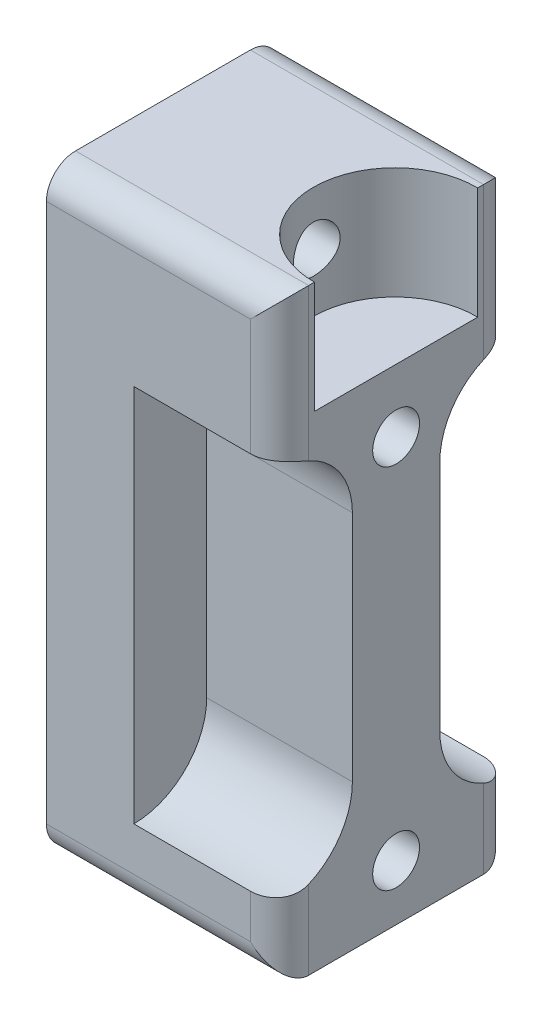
ISO-10303-21;
HEADER;
FILE_DESCRIPTION(('STEP AP214'),'2;1');
FILE_NAME('part.step','',(''),(''),'','','');
FILE_SCHEMA(('AUTOMOTIVE_DESIGN { 1 0 10303 214 1 1 1 1 }'));
ENDSEC;
DATA;
#1=APPLICATION_CONTEXT('core data for automotive mechanical design processes');
#2=APPLICATION_PROTOCOL_DEFINITION('international standard','automotive_design',2000,#1);
#3=PRODUCT_CONTEXT('',#1,'mechanical');
#4=PRODUCT('Part','Part','',(#3));
#5=PRODUCT_RELATED_PRODUCT_CATEGORY('part','',(#4));
#6=PRODUCT_DEFINITION_FORMATION('','',#4);
#7=PRODUCT_DEFINITION_CONTEXT('part definition',#1,'design');
#8=PRODUCT_DEFINITION('design','',#6,#7);
#9=PRODUCT_DEFINITION_SHAPE('','',#8);
#10=(LENGTH_UNIT() NAMED_UNIT(*) SI_UNIT(.MILLI.,.METRE.));
#11=(NAMED_UNIT(*) PLANE_ANGLE_UNIT() SI_UNIT($,.RADIAN.));
#12=(NAMED_UNIT(*) SI_UNIT($,.STERADIAN.) SOLID_ANGLE_UNIT());
#13=UNCERTAINTY_MEASURE_WITH_UNIT(LENGTH_MEASURE(1.E-05),#10,'distance_accuracy_value','');
#14=(GEOMETRIC_REPRESENTATION_CONTEXT(3) GLOBAL_UNCERTAINTY_ASSIGNED_CONTEXT((#13)) GLOBAL_UNIT_ASSIGNED_CONTEXT((#10,
#11,#12)) REPRESENTATION_CONTEXT('',''));
#15=CARTESIAN_POINT('',(0.,0.,0.));
#16=DIRECTION('',(0.,0.,1.));
#17=DIRECTION('',(1.,0.,0.));
#18=AXIS2_PLACEMENT_3D('',#15,#16,#17);
#19=CARTESIAN_POINT('',(-25.273,-65.0875000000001,-12.7));
#20=DIRECTION('',(-1.,0.,0.));
#21=DIRECTION('',(0.,0.,1.));
#22=AXIS2_PLACEMENT_3D('',#19,#20,#21);
#23=PLANE('',#22);
#24=CARTESIAN_POINT('',(-25.273,-5.842,0.));
#25=DIRECTION('',(-1.,0.,0.));
#26=DIRECTION('',(0.,0.,1.));
#27=AXIS2_PLACEMENT_3D('',#24,#25,#26);
#28=CIRCLE('',#27,2.5527);
#29=CARTESIAN_POINT('',(-25.273,-5.842,2.5527));
#30=VERTEX_POINT('',#29);
#31=EDGE_CURVE('E235',#30,#30,#28,.T.);
#32=ORIENTED_EDGE('',*,*,#31,.F.);
#33=EDGE_LOOP('',(#32));
#34=FACE_BOUND('',#33,.T.);
#35=CARTESIAN_POINT('',(-25.273,-59.02325,0.));
#36=DIRECTION('',(-1.,0.,0.));
#37=DIRECTION('',(0.,0.,1.));
#38=AXIS2_PLACEMENT_3D('',#35,#36,#37);
#39=CIRCLE('',#38,2.5527);
#40=CARTESIAN_POINT('',(-25.273,-59.02325,2.5527));
#41=VERTEX_POINT('',#40);
#42=EDGE_CURVE('E239',#41,#41,#39,.T.);
#43=ORIENTED_EDGE('',*,*,#42,.F.);
#44=EDGE_LOOP('',(#43));
#45=FACE_BOUND('',#44,.T.);
#46=CARTESIAN_POINT('',(-25.273,-19.05,0.));
#47=DIRECTION('',(-1.,0.,0.));
#48=DIRECTION('',(0.,0.,1.));
#49=AXIS2_PLACEMENT_3D('',#46,#47,#48);
#50=CIRCLE('',#49,2.5527);
#51=CARTESIAN_POINT('',(-25.273,-19.05,2.5527));
#52=VERTEX_POINT('',#51);
#53=EDGE_CURVE('E245',#52,#52,#50,.T.);
#54=ORIENTED_EDGE('',*,*,#53,.F.);
#55=EDGE_LOOP('',(#54));
#56=FACE_BOUND('',#55,.T.);
#57=DIRECTION('',(0.,1.,0.));
#58=VECTOR('',#57,1.);
#59=CARTESIAN_POINT('',(-25.273,-65.0875000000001,12.7));
#60=LINE('',#59,#58);
#61=CARTESIAN_POINT('',(-25.273,-61.9125000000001,12.7));
#62=VERTEX_POINT('',#61);
#63=CARTESIAN_POINT('',(-25.273,-3.175,12.7));
#64=VERTEX_POINT('',#63);
#65=EDGE_CURVE('E266',#62,#64,#60,.T.);
#66=ORIENTED_EDGE('',*,*,#65,.T.);
#67=CARTESIAN_POINT('',(-25.273,-3.175,9.525));
#68=DIRECTION('',(-1.,0.,0.));
#69=DIRECTION('',(0.,0.,1.));
#70=AXIS2_PLACEMENT_3D('',#67,#68,#69);
#71=CIRCLE('',#70,3.175);
#72=CARTESIAN_POINT('',(-25.273,0.,9.525));
#73=VERTEX_POINT('',#72);
#74=EDGE_CURVE('E479',#64,#73,#71,.T.);
#75=ORIENTED_EDGE('',*,*,#74,.T.);
#76=DIRECTION('',(0.,0.,1.));
#77=VECTOR('',#76,1.);
#78=CARTESIAN_POINT('',(-25.273,0.,-12.7));
#79=LINE('',#78,#77);
#80=CARTESIAN_POINT('',(-25.273,0.,-9.52499999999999));
#81=VERTEX_POINT('',#80);
#82=EDGE_CURVE('E258',#81,#73,#79,.T.);
#83=ORIENTED_EDGE('',*,*,#82,.F.);
#84=CARTESIAN_POINT('',(-25.273,-3.175,-9.52499999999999));
#85=DIRECTION('',(-1.,0.,0.));
#86=DIRECTION('',(0.,0.,1.));
#87=AXIS2_PLACEMENT_3D('',#84,#85,#86);
#88=CIRCLE('',#87,3.175);
#89=CARTESIAN_POINT('',(-25.273,-3.175,-12.7));
#90=VERTEX_POINT('',#89);
#91=EDGE_CURVE('E477',#81,#90,#88,.T.);
#92=ORIENTED_EDGE('',*,*,#91,.T.);
#93=DIRECTION('',(0.,1.,0.));
#94=VECTOR('',#93,1.);
#95=CARTESIAN_POINT('',(-25.273,-65.0875000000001,-12.7));
#96=LINE('',#95,#94);
#97=CARTESIAN_POINT('',(-25.273,-61.9125000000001,-12.7));
#98=VERTEX_POINT('',#97);
#99=EDGE_CURVE('E271',#98,#90,#96,.T.);
#100=ORIENTED_EDGE('',*,*,#99,.F.);
#101=CARTESIAN_POINT('',(-25.273,-61.9125000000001,-9.52499999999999));
#102=DIRECTION('',(-1.,0.,0.));
#103=DIRECTION('',(0.,0.,1.));
#104=AXIS2_PLACEMENT_3D('',#101,#102,#103);
#105=CIRCLE('',#104,3.175);
#106=CARTESIAN_POINT('',(-25.273,-65.0875000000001,-9.52499999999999));
#107=VERTEX_POINT('',#106);
#108=EDGE_CURVE('E474',#98,#107,#105,.T.);
#109=ORIENTED_EDGE('',*,*,#108,.T.);
#110=DIRECTION('',(0.,0.,1.));
#111=VECTOR('',#110,1.);
#112=CARTESIAN_POINT('',(-25.273,-65.0875000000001,-12.7));
#113=LINE('',#112,#111);
#114=CARTESIAN_POINT('',(-25.273,-65.0875000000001,9.525));
#115=VERTEX_POINT('',#114);
#116=EDGE_CURVE('E259',#107,#115,#113,.T.);
#117=ORIENTED_EDGE('',*,*,#116,.T.);
#118=CARTESIAN_POINT('',(-25.273,-61.9125000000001,9.525));
#119=DIRECTION('',(-1.,0.,0.));
#120=DIRECTION('',(0.,0.,1.));
#121=AXIS2_PLACEMENT_3D('',#118,#119,#120);
#122=CIRCLE('',#121,3.175);
#123=EDGE_CURVE('E471',#115,#62,#122,.T.);
#124=ORIENTED_EDGE('',*,*,#123,.T.);
#125=EDGE_LOOP('',(#66,#75,#83,#92,#100,#109,#117,#124));
#126=FACE_BOUND('',#125,.T.);
#127=ADVANCED_FACE('F36',(#34,#45,#56,#126),#23,.T.);
#128=CARTESIAN_POINT('',(-25.273,-65.0875000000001,-12.7));
#129=DIRECTION('',(0.,0.,-1.));
#130=DIRECTION('',(-1.,0.,0.));
#131=AXIS2_PLACEMENT_3D('',#128,#129,#130);
#132=PLANE('',#131);
#133=DIRECTION('',(0.,1.,0.));
#134=VECTOR('',#133,1.);
#135=CARTESIAN_POINT('',(-3.048,-65.0875000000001,-12.7));
#136=LINE('',#135,#134);
#137=CARTESIAN_POINT('',(-3.04800000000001,-57.15,-12.7));
#138=VERTEX_POINT('',#137);
#139=CARTESIAN_POINT('',(-3.048,-61.9125000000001,-12.7));
#140=VERTEX_POINT('',#139);
#141=EDGE_CURVE('E456',#138,#140,#136,.F.);
#142=ORIENTED_EDGE('',*,*,#141,.T.);
#143=DIRECTION('',(-1.,0.,0.));
#144=VECTOR('',#143,1.);
#145=CARTESIAN_POINT('',(-25.273,-61.9125000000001,-12.7));
#146=LINE('',#145,#144);
#147=EDGE_CURVE('E400',#140,#98,#146,.T.);
#148=ORIENTED_EDGE('',*,*,#147,.T.);
#149=ORIENTED_EDGE('',*,*,#99,.T.);
#150=DIRECTION('',(-1.,0.,0.));
#151=VECTOR('',#150,1.);
#152=CARTESIAN_POINT('',(-25.273,-3.175,-12.7));
#153=LINE('',#152,#151);
#154=CARTESIAN_POINT('',(-3.048,-3.175,-12.7));
#155=VERTEX_POINT('',#154);
#156=EDGE_CURVE('E459',#90,#155,#153,.F.);
#157=ORIENTED_EDGE('',*,*,#156,.T.);
#158=DIRECTION('',(0.,1.,0.));
#159=VECTOR('',#158,1.);
#160=CARTESIAN_POINT('',(-3.048,-65.0875000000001,-12.7));
#161=LINE('',#160,#159);
#162=CARTESIAN_POINT('',(-3.04800000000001,-15.875,-12.7));
#163=VERTEX_POINT('',#162);
#164=EDGE_CURVE('E462',#155,#163,#161,.F.);
#165=ORIENTED_EDGE('',*,*,#164,.T.);
#166=DIRECTION('',(1.,0.,0.));
#167=VECTOR('',#166,1.);
#168=CARTESIAN_POINT('',(-15.748,-15.875,-12.7));
#169=LINE('',#168,#167);
#170=CARTESIAN_POINT('',(-15.748,-15.875,-12.7));
#171=VERTEX_POINT('',#170);
#172=EDGE_CURVE('E229',#171,#163,#169,.T.);
#173=ORIENTED_EDGE('',*,*,#172,.F.);
#174=DIRECTION('',(0.,-1.,0.));
#175=VECTOR('',#174,1.);
#176=CARTESIAN_POINT('',(-15.748,-65.0875000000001,-12.7));
#177=LINE('',#176,#175);
#178=CARTESIAN_POINT('',(-15.748,-57.15,-12.7));
#179=VERTEX_POINT('',#178);
#180=EDGE_CURVE('E458',#171,#179,#177,.T.);
#181=ORIENTED_EDGE('',*,*,#180,.T.);
#182=DIRECTION('',(1.,0.,0.));
#183=VECTOR('',#182,1.);
#184=CARTESIAN_POINT('',(-15.748,-57.15,-12.7));
#185=LINE('',#184,#183);
#186=EDGE_CURVE('E233',#138,#179,#185,.F.);
#187=ORIENTED_EDGE('',*,*,#186,.F.);
#188=EDGE_LOOP('',(#142,#148,#149,#157,#165,#173,#181,#187));
#189=FACE_BOUND('',#188,.T.);
#190=ADVANCED_FACE('F319',(#189),#132,.T.);
#191=CARTESIAN_POINT('',(0.126999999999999,-65.0875000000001,-12.7));
#192=DIRECTION('',(1.,0.,0.));
#193=DIRECTION('',(0.,0.,-1.));
#194=AXIS2_PLACEMENT_3D('',#191,#192,#193);
#195=PLANE('',#194);
#196=CARTESIAN_POINT('',(0.127000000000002,-49.2125,12.7));
#197=DIRECTION('',(1.,0.,0.));
#198=DIRECTION('',(0.,0.,1.));
#199=AXIS2_PLACEMENT_3D('',#196,#197,#198);
#200=CIRCLE('',#199,7.9375);
#201=CARTESIAN_POINT('',(0.127000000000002,-56.4873389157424,9.525));
#202=VERTEX_POINT('',#201);
#203=CARTESIAN_POINT('',(0.127000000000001,-49.2125,4.7625));
#204=VERTEX_POINT('',#203);
#205=EDGE_CURVE('E194',#202,#204,#200,.T.);
#206=ORIENTED_EDGE('',*,*,#205,.F.);
#207=DIRECTION('',(0.,1.,0.));
#208=VECTOR('',#207,1.);
#209=CARTESIAN_POINT('',(0.127000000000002,-65.0875000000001,9.525));
#210=LINE('',#209,#208);
#211=CARTESIAN_POINT('',(0.127000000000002,-65.0875000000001,9.525));
#212=VERTEX_POINT('',#211);
#213=EDGE_CURVE('E443',#202,#212,#210,.F.);
#214=ORIENTED_EDGE('',*,*,#213,.T.);
#215=DIRECTION('',(0.,0.,-1.));
#216=VECTOR('',#215,1.);
#217=CARTESIAN_POINT('',(0.126999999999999,-65.0875000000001,-12.7));
#218=LINE('',#217,#216);
#219=CARTESIAN_POINT('',(0.126999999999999,-65.0875000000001,-9.525));
#220=VERTEX_POINT('',#219);
#221=EDGE_CURVE('E262',#212,#220,#218,.T.);
#222=ORIENTED_EDGE('',*,*,#221,.T.);
#223=DIRECTION('',(0.,1.,0.));
#224=VECTOR('',#223,1.);
#225=CARTESIAN_POINT('',(0.126999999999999,-65.0875000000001,-9.525));
#226=LINE('',#225,#224);
#227=CARTESIAN_POINT('',(0.126999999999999,-56.4873389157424,-9.525));
#228=VERTEX_POINT('',#227);
#229=EDGE_CURVE('E442',#220,#228,#226,.T.);
#230=ORIENTED_EDGE('',*,*,#229,.T.);
#231=CARTESIAN_POINT('',(0.126999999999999,-49.2125,-12.7));
#232=DIRECTION('',(1.,0.,0.));
#233=DIRECTION('',(0.,0.,-1.));
#234=AXIS2_PLACEMENT_3D('',#231,#232,#233);
#235=CIRCLE('',#234,7.9375);
#236=CARTESIAN_POINT('',(0.127,-49.2125,-4.7625));
#237=VERTEX_POINT('',#236);
#238=EDGE_CURVE('E211',#237,#228,#235,.T.);
#239=ORIENTED_EDGE('',*,*,#238,.F.);
#240=DIRECTION('',(0.,-1.,0.));
#241=VECTOR('',#240,1.);
#242=CARTESIAN_POINT('',(0.127,-49.2125,-4.7625));
#243=LINE('',#242,#241);
#244=CARTESIAN_POINT('',(0.127,-23.8125,-4.7625));
#245=VERTEX_POINT('',#244);
#246=EDGE_CURVE('E217',#245,#237,#243,.T.);
#247=ORIENTED_EDGE('',*,*,#246,.F.);
#248=CARTESIAN_POINT('',(0.126999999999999,-23.8125,-12.7));
#249=DIRECTION('',(1.,0.,0.));
#250=DIRECTION('',(0.,0.,-1.));
#251=AXIS2_PLACEMENT_3D('',#248,#249,#250);
#252=CIRCLE('',#251,7.9375);
#253=CARTESIAN_POINT('',(0.126999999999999,-16.5376610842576,-9.525));
#254=VERTEX_POINT('',#253);
#255=EDGE_CURVE('E282',#254,#245,#252,.T.);
#256=ORIENTED_EDGE('',*,*,#255,.F.);
#257=DIRECTION('',(0.,1.,0.));
#258=VECTOR('',#257,1.);
#259=CARTESIAN_POINT('',(0.126999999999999,-65.0875000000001,-9.525));
#260=LINE('',#259,#258);
#261=CARTESIAN_POINT('',(0.126999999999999,0.,-9.525));
#262=VERTEX_POINT('',#261);
#263=EDGE_CURVE('E424',#254,#262,#260,.T.);
#264=ORIENTED_EDGE('',*,*,#263,.T.);
#265=DIRECTION('',(0.,0.,-1.));
#266=VECTOR('',#265,1.);
#267=CARTESIAN_POINT('',(0.126999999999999,0.,-12.7));
#268=LINE('',#267,#266);
#269=CARTESIAN_POINT('',(0.126999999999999,0.,-8.88909281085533));
#270=VERTEX_POINT('',#269);
#271=EDGE_CURVE('E269',#270,#262,#268,.T.);
#272=ORIENTED_EDGE('',*,*,#271,.F.);
#273=DIRECTION('',(0.,1.,0.));
#274=VECTOR('',#273,1.);
#275=CARTESIAN_POINT('',(0.126999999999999,-12.192,-8.88909281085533));
#276=LINE('',#275,#274);
#277=CARTESIAN_POINT('',(0.126999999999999,-12.192,-8.88909281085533));
#278=VERTEX_POINT('',#277);
#279=EDGE_CURVE('E256',#278,#270,#276,.T.);
#280=ORIENTED_EDGE('',*,*,#279,.F.);
#281=DIRECTION('',(0.,0.,1.));
#282=VECTOR('',#281,1.);
#283=CARTESIAN_POINT('',(0.126999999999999,-12.192,-12.7));
#284=LINE('',#283,#282);
#285=CARTESIAN_POINT('',(0.127000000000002,-12.192,8.88909281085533));
#286=VERTEX_POINT('',#285);
#287=EDGE_CURVE('E279',#278,#286,#284,.T.);
#288=ORIENTED_EDGE('',*,*,#287,.T.);
#289=DIRECTION('',(0.,1.,0.));
#290=VECTOR('',#289,1.);
#291=CARTESIAN_POINT('',(0.127000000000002,-12.192,8.88909281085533));
#292=LINE('',#291,#290);
#293=CARTESIAN_POINT('',(0.127000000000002,0.,8.88909281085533));
#294=VERTEX_POINT('',#293);
#295=EDGE_CURVE('E254',#294,#286,#292,.F.);
#296=ORIENTED_EDGE('',*,*,#295,.F.);
#297=CARTESIAN_POINT('',(0.127000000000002,0.,9.525));
#298=VERTEX_POINT('',#297);
#299=EDGE_CURVE('E263',#298,#294,#268,.T.);
#300=ORIENTED_EDGE('',*,*,#299,.F.);
#301=DIRECTION('',(0.,1.,0.));
#302=VECTOR('',#301,1.);
#303=CARTESIAN_POINT('',(0.127000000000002,-65.0875000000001,9.525));
#304=LINE('',#303,#302);
#305=CARTESIAN_POINT('',(0.127000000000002,-16.5376610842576,9.525));
#306=VERTEX_POINT('',#305);
#307=EDGE_CURVE('E54',#298,#306,#304,.F.);
#308=ORIENTED_EDGE('',*,*,#307,.T.);
#309=CARTESIAN_POINT('',(0.127000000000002,-23.8125,12.7));
#310=DIRECTION('',(1.,0.,0.));
#311=DIRECTION('',(0.,0.,1.));
#312=AXIS2_PLACEMENT_3D('',#309,#310,#311);
#313=CIRCLE('',#312,7.9375);
#314=CARTESIAN_POINT('',(0.127000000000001,-23.8125,4.7625));
#315=VERTEX_POINT('',#314);
#316=EDGE_CURVE('E188',#315,#306,#313,.T.);
#317=ORIENTED_EDGE('',*,*,#316,.F.);
#318=DIRECTION('',(0.,1.,0.));
#319=VECTOR('',#318,1.);
#320=CARTESIAN_POINT('',(0.127000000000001,-49.2125,4.7625));
#321=LINE('',#320,#319);
#322=EDGE_CURVE('E207',#204,#315,#321,.T.);
#323=ORIENTED_EDGE('',*,*,#322,.F.);
#324=EDGE_LOOP('',(#206,#214,#222,#230,#239,#247,#256,#264,#272,#280,#288,#296,#300,#308,#317,#323));
#325=FACE_BOUND('',#324,.T.);
#326=CARTESIAN_POINT('',(0.127000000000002,-59.02325,0.));
#327=DIRECTION('',(-1.,0.,0.));
#328=DIRECTION('',(0.,0.,1.));
#329=AXIS2_PLACEMENT_3D('',#326,#327,#328);
#330=CIRCLE('',#329,2.55269999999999);
#331=CARTESIAN_POINT('',(0.127000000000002,-59.02325,2.55269999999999));
#332=VERTEX_POINT('',#331);
#333=EDGE_CURVE('E242',#332,#332,#330,.T.);
#334=ORIENTED_EDGE('',*,*,#333,.T.);
#335=EDGE_LOOP('',(#334));
#336=FACE_BOUND('',#335,.T.);
#337=CARTESIAN_POINT('',(0.127000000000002,-19.05,0.));
#338=DIRECTION('',(-1.,0.,0.));
#339=DIRECTION('',(0.,0.,1.));
#340=AXIS2_PLACEMENT_3D('',#337,#338,#339);
#341=CIRCLE('',#340,2.55269999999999);
#342=CARTESIAN_POINT('',(0.127000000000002,-19.05,2.55269999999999));
#343=VERTEX_POINT('',#342);
#344=EDGE_CURVE('E248',#343,#343,#341,.T.);
#345=ORIENTED_EDGE('',*,*,#344,.T.);
#346=EDGE_LOOP('',(#345));
#347=FACE_BOUND('',#346,.T.);
#348=ADVANCED_FACE('F325',(#325,#336,#347),#195,.T.);
#349=CARTESIAN_POINT('',(-25.273,-65.0875000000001,12.7));
#350=DIRECTION('',(0.,0.,1.));
#351=DIRECTION('',(1.,0.,0.));
#352=AXIS2_PLACEMENT_3D('',#349,#350,#351);
#353=PLANE('',#352);
#354=ORIENTED_EDGE('',*,*,#65,.F.);
#355=DIRECTION('',(1.,0.,0.));
#356=VECTOR('',#355,1.);
#357=CARTESIAN_POINT('',(0.127000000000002,-61.9125000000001,12.7));
#358=LINE('',#357,#356);
#359=CARTESIAN_POINT('',(-3.048,-61.9125000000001,12.7));
#360=VERTEX_POINT('',#359);
#361=EDGE_CURVE('E476',#62,#360,#358,.T.);
#362=ORIENTED_EDGE('',*,*,#361,.T.);
#363=DIRECTION('',(0.,1.,0.));
#364=VECTOR('',#363,1.);
#365=CARTESIAN_POINT('',(-3.048,-65.0875000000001,12.7));
#366=LINE('',#365,#364);
#367=CARTESIAN_POINT('',(-3.048,-57.15,12.7));
#368=VERTEX_POINT('',#367);
#369=EDGE_CURVE('E660',#360,#368,#366,.T.);
#370=ORIENTED_EDGE('',*,*,#369,.T.);
#371=DIRECTION('',(1.,0.,0.));
#372=VECTOR('',#371,1.);
#373=CARTESIAN_POINT('',(-15.748,-57.15,12.7));
#374=LINE('',#373,#372);
#375=CARTESIAN_POINT('',(-15.748,-57.15,12.7));
#376=VERTEX_POINT('',#375);
#377=EDGE_CURVE('E652',#376,#368,#374,.T.);
#378=ORIENTED_EDGE('',*,*,#377,.F.);
#379=DIRECTION('',(0.,-1.,0.));
#380=VECTOR('',#379,1.);
#381=CARTESIAN_POINT('',(-15.748,-65.0875000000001,12.7));
#382=LINE('',#381,#380);
#383=CARTESIAN_POINT('',(-15.748,-15.875,12.7));
#384=VERTEX_POINT('',#383);
#385=EDGE_CURVE('E184',#384,#376,#382,.T.);
#386=ORIENTED_EDGE('',*,*,#385,.F.);
#387=DIRECTION('',(1.,0.,0.));
#388=VECTOR('',#387,1.);
#389=CARTESIAN_POINT('',(-15.748,-15.875,12.7));
#390=LINE('',#389,#388);
#391=CARTESIAN_POINT('',(-3.048,-15.875,12.7));
#392=VERTEX_POINT('',#391);
#393=EDGE_CURVE('E654',#392,#384,#390,.F.);
#394=ORIENTED_EDGE('',*,*,#393,.F.);
#395=DIRECTION('',(0.,1.,0.));
#396=VECTOR('',#395,1.);
#397=CARTESIAN_POINT('',(-3.048,-65.0875000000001,12.7));
#398=LINE('',#397,#396);
#399=CARTESIAN_POINT('',(-3.048,-3.175,12.7));
#400=VERTEX_POINT('',#399);
#401=EDGE_CURVE('E429',#392,#400,#398,.T.);
#402=ORIENTED_EDGE('',*,*,#401,.T.);
#403=DIRECTION('',(1.,0.,0.));
#404=VECTOR('',#403,1.);
#405=CARTESIAN_POINT('',(-25.273,-3.175,12.7));
#406=LINE('',#405,#404);
#407=EDGE_CURVE('E421',#400,#64,#406,.F.);
#408=ORIENTED_EDGE('',*,*,#407,.T.);
#409=EDGE_LOOP('',(#354,#362,#370,#378,#386,#394,#402,#408));
#410=FACE_BOUND('',#409,.T.);
#411=ADVANCED_FACE('F332',(#410),#353,.T.);
#412=CARTESIAN_POINT('',(-25.273,-65.0875000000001,12.7));
#413=DIRECTION('',(0.,1.,0.));
#414=DIRECTION('',(0.,0.,1.));
#415=AXIS2_PLACEMENT_3D('',#412,#413,#414);
#416=PLANE('',#415);
#417=ORIENTED_EDGE('',*,*,#221,.F.);
#418=DIRECTION('',(1.,0.,0.));
#419=VECTOR('',#418,1.);
#420=CARTESIAN_POINT('',(-25.273,-65.0875000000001,9.525));
#421=LINE('',#420,#419);
#422=EDGE_CURVE('E378',#212,#115,#421,.F.);
#423=ORIENTED_EDGE('',*,*,#422,.T.);
#424=ORIENTED_EDGE('',*,*,#116,.F.);
#425=DIRECTION('',(-1.,0.,0.));
#426=VECTOR('',#425,1.);
#427=CARTESIAN_POINT('',(0.126999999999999,-65.0875000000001,-9.525));
#428=LINE('',#427,#426);
#429=EDGE_CURVE('E398',#107,#220,#428,.F.);
#430=ORIENTED_EDGE('',*,*,#429,.T.);
#431=EDGE_LOOP('',(#417,#423,#424,#430));
#432=FACE_BOUND('',#431,.T.);
#433=ADVANCED_FACE('F468',(#432),#416,.F.);
#434=CARTESIAN_POINT('',(-25.273,0.,12.7));
#435=DIRECTION('',(0.,1.,0.));
#436=DIRECTION('',(0.,0.,1.));
#437=AXIS2_PLACEMENT_3D('',#434,#435,#436);
#438=PLANE('',#437);
#439=ORIENTED_EDGE('',*,*,#82,.T.);
#440=DIRECTION('',(1.,0.,0.));
#441=VECTOR('',#440,1.);
#442=CARTESIAN_POINT('',(-25.273,0.,9.525));
#443=LINE('',#442,#441);
#444=EDGE_CURVE('E420',#73,#298,#443,.T.);
#445=ORIENTED_EDGE('',*,*,#444,.T.);
#446=ORIENTED_EDGE('',*,*,#299,.T.);
#447=CARTESIAN_POINT('',(0.,0.,0.));
#448=DIRECTION('',(0.,1.,0.));
#449=DIRECTION('',(0.,0.,1.));
#450=AXIS2_PLACEMENT_3D('',#447,#448,#449);
#451=CIRCLE('',#450,8.89);
#452=EDGE_CURVE('E274',#270,#294,#451,.T.);
#453=ORIENTED_EDGE('',*,*,#452,.F.);
#454=ORIENTED_EDGE('',*,*,#271,.T.);
#455=DIRECTION('',(-1.,0.,0.));
#456=VECTOR('',#455,1.);
#457=CARTESIAN_POINT('',(-25.273,0.,-9.52499999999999));
#458=LINE('',#457,#456);
#459=EDGE_CURVE('E430',#262,#81,#458,.T.);
#460=ORIENTED_EDGE('',*,*,#459,.T.);
#461=EDGE_LOOP('',(#439,#445,#446,#453,#454,#460));
#462=FACE_BOUND('',#461,.T.);
#463=ADVANCED_FACE('F316',(#462),#438,.T.);
#464=CARTESIAN_POINT('',(0.,-12.192,0.));
#465=DIRECTION('',(0.,1.,0.));
#466=DIRECTION('',(0.,0.,1.));
#467=AXIS2_PLACEMENT_3D('',#464,#465,#466);
#468=CYLINDRICAL_SURFACE('',#467,8.89);
#469=CARTESIAN_POINT('',(-8.51562227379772,-5.842,2.5527));
#470=CARTESIAN_POINT('',(-8.51562419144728,-5.70182325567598,2.55269754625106));
#471=CARTESIAN_POINT('',(-8.51912134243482,-5.56162178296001,2.54111437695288));
#472=CARTESIAN_POINT('',(-8.53268191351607,-5.285297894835,2.49519436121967));
#473=CARTESIAN_POINT('',(-8.54274795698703,-5.14917713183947,2.46084842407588));
#474=CARTESIAN_POINT('',(-8.56821432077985,-4.88505342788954,2.37064927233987));
#475=CARTESIAN_POINT('',(-8.58360631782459,-4.75703818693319,2.31482960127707));
#476=CARTESIAN_POINT('',(-8.61797930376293,-4.51216222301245,2.18337583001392));
#477=CARTESIAN_POINT('',(-8.63696072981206,-4.39530286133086,2.10773931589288));
#478=CARTESIAN_POINT('',(-8.67699084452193,-4.17266805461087,1.93645220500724));
#479=CARTESIAN_POINT('',(-8.69808070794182,-4.0672639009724,1.84032852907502));
#480=CARTESIAN_POINT('',(-8.7395982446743,-3.87382861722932,1.63181097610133));
#481=CARTESIAN_POINT('',(-8.76002583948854,-3.7857995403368,1.51941517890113));
#482=CARTESIAN_POINT('',(-8.79838164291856,-3.62802656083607,1.2789291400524));
#483=CARTESIAN_POINT('',(-8.81625565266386,-3.55865746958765,1.15058360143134));
#484=CARTESIAN_POINT('',(-8.84701436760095,-3.44262783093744,0.883449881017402));
#485=CARTESIAN_POINT('',(-8.859900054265,-3.39596281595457,0.74466375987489));
#486=CARTESIAN_POINT('',(-8.87893900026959,-3.32788389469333,0.464469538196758));
#487=CARTESIAN_POINT('',(-8.88526069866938,-3.30583707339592,0.323226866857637));
#488=CARTESIAN_POINT('',(-8.89105086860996,-3.28562307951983,0.0389154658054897));
#489=CARTESIAN_POINT('',(-8.89052066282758,-3.28745129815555,-0.104152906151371));
#490=CARTESIAN_POINT('',(-8.88278756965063,-3.31450231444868,-0.383628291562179));
#491=CARTESIAN_POINT('',(-8.8757799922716,-3.339040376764,-0.520107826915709));
#492=CARTESIAN_POINT('',(-8.85611412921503,-3.40970093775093,-0.786923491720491));
#493=CARTESIAN_POINT('',(-8.8434554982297,-3.45582475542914,-0.917259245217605));
#494=CARTESIAN_POINT('',(-8.81363204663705,-3.5688351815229,-1.16976296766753));
#495=CARTESIAN_POINT('',(-8.79641916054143,-3.63594473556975,-1.29182524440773));
#496=CARTESIAN_POINT('',(-8.75932467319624,-3.78884750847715,-1.5231806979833));
#497=CARTESIAN_POINT('',(-8.73944248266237,-3.87464485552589,-1.63247104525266));
#498=CARTESIAN_POINT('',(-8.69831659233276,-4.06607315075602,-1.83926812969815));
#499=CARTESIAN_POINT('',(-8.67704961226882,-4.17229915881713,-1.93622010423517));
#500=CARTESIAN_POINT('',(-8.6361748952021,-4.39971562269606,-2.11108235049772));
#501=CARTESIAN_POINT('',(-8.61656729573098,-4.52090731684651,-2.18899104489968));
#502=CARTESIAN_POINT('',(-8.58112679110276,-4.77617173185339,-2.32406986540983));
#503=CARTESIAN_POINT('',(-8.5653258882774,-4.91034121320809,-2.38106614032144));
#504=CARTESIAN_POINT('',(-8.53967339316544,-5.18692957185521,-2.47150014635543));
#505=CARTESIAN_POINT('',(-8.52982004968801,-5.32934600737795,-2.50494481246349));
#506=CARTESIAN_POINT('',(-8.51755824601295,-5.61314167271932,-2.54632171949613));
#507=CARTESIAN_POINT('',(-8.51490563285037,-5.75438842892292,-2.55509101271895));
#508=CARTESIAN_POINT('',(-8.5166732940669,-6.03633507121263,-2.54919338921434));
#509=CARTESIAN_POINT('',(-8.52109267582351,-6.17703502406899,-2.5345294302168));
#510=CARTESIAN_POINT('',(-8.53626821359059,-6.4505107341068,-2.48292418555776));
#511=CARTESIAN_POINT('',(-8.54687502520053,-6.5833945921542,-2.44650746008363));
#512=CARTESIAN_POINT('',(-8.57307907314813,-6.84116206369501,-2.35303123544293));
#513=CARTESIAN_POINT('',(-8.58867703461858,-6.96604451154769,-2.2959687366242));
#514=CARTESIAN_POINT('',(-8.62359029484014,-7.20770757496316,-2.16118903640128));
#515=CARTESIAN_POINT('',(-8.64298863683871,-7.32420828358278,-2.08299198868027));
#516=CARTESIAN_POINT('',(-8.68313197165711,-7.54274074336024,-1.90874255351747));
#517=CARTESIAN_POINT('',(-8.70387725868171,-7.64476931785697,-1.81268625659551));
#518=CARTESIAN_POINT('',(-8.7452346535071,-7.83504765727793,-1.60153473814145));
#519=CARTESIAN_POINT('',(-8.76581801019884,-7.92270776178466,-1.4859012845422));
#520=CARTESIAN_POINT('',(-8.8038134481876,-8.07738523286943,-1.24108430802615));
#521=CARTESIAN_POINT('',(-8.82122569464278,-8.14440367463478,-1.11190149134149));
#522=CARTESIAN_POINT('',(-8.85080652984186,-8.25525450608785,-0.8445438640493));
#523=CARTESIAN_POINT('',(-8.86301465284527,-8.29926230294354,-0.706446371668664));
#524=CARTESIAN_POINT('',(-8.88098634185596,-8.36331986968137,-0.424406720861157));
#525=CARTESIAN_POINT('',(-8.88675158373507,-8.38337586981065,-0.280466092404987));
#526=CARTESIAN_POINT('',(-8.89109493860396,-8.39851944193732,0.00370191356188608));
#527=CARTESIAN_POINT('',(-8.88992026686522,-8.39446581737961,0.143880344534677));
#528=CARTESIAN_POINT('',(-8.88108905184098,-8.36353471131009,0.421475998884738));
#529=CARTESIAN_POINT('',(-8.87343282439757,-8.33665834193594,0.558893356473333));
#530=CARTESIAN_POINT('',(-8.85256105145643,-8.26135919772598,0.825860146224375));
#531=CARTESIAN_POINT('',(-8.8393967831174,-8.21313492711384,0.955469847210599));
#532=CARTESIAN_POINT('',(-8.80887524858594,-8.096685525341,1.20482973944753));
#533=CARTESIAN_POINT('',(-8.79151732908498,-8.02845727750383,1.32457839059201));
#534=CARTESIAN_POINT('',(-8.75379809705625,-7.87156061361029,1.55471305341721));
#535=CARTESIAN_POINT('',(-8.73336237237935,-7.78234096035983,1.66471098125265));
#536=CARTESIAN_POINT('',(-8.69205253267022,-7.58700756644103,1.8684625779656));
#537=CARTESIAN_POINT('',(-8.67117829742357,-7.48088913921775,1.96221172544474));
#538=CARTESIAN_POINT('',(-8.63070644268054,-7.25137797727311,2.13329687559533));
#539=CARTESIAN_POINT('',(-8.6111575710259,-7.12760073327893,2.21012977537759));
#540=CARTESIAN_POINT('',(-8.57629035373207,-6.8683411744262,2.34179660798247));
#541=CARTESIAN_POINT('',(-8.56096967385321,-6.73286537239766,2.39664268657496));
#542=CARTESIAN_POINT('',(-8.53805717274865,-6.47223641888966,2.4769305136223));
#543=CARTESIAN_POINT('',(-8.52971886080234,-6.3480352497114,2.5052705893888));
#544=CARTESIAN_POINT('',(-8.51850098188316,-6.09656251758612,2.54315492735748));
#545=CARTESIAN_POINT('',(-8.51562053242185,-5.96929145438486,2.55270222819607));
#546=CARTESIAN_POINT('',(-8.51562227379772,-5.842,2.5527));
#547=B_SPLINE_CURVE_WITH_KNOTS('',3,(#469,#470,#471,#472,#473,#474,#475,#476,#477,#478,#479,
#480,#481,#482,#483,#484,#485,#486,#487,#488,#489,#490,#491,#492,#493,#494,#495,#496,#497,#498,
#499,#500,#501,#502,#503,#504,#505,#506,#507,#508,#509,#510,#511,#512,#513,#514,#515,#516,#517,
#518,#519,#520,#521,#522,#523,#524,#525,#526,#527,#528,#529,#530,#531,#532,#533,#534,#535,#536,
#537,#538,#539,#540,#541,#542,#543,#544,#545,#546),.UNSPECIFIED.,.T.,.F.,(4,2,2,2,2,2,2,2,2,2,2,
2,2,2,2,2,2,2,2,2,2,2,2,2,2,2,2,2,2,2,2,2,2,2,2,2,2,2,4),(0.,0.420061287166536,0.84029043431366,
1.25986580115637,1.67949230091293,2.11012949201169,2.54081754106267,2.97960127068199,
3.41829862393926,3.84543728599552,4.27249349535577,4.68707866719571,5.10168917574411,
5.52086325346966,5.94013002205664,6.37425310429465,6.80841213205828,7.24610278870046,
7.6836645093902,8.10619292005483,8.52866800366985,8.94134472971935,9.35408143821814,
9.77711669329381,10.2002446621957,10.6378250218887,11.075382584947,11.5095542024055,
11.9436128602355,12.3623048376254,12.7809764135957,13.1958341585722,13.6107565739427,
14.0381123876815,14.4655869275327,14.904435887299,15.343042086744,15.7245523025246,
16.106000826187),.UNSPECIFIED.);
#548=CARTESIAN_POINT('',(-8.51562227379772,-5.842,2.5527));
#549=VERTEX_POINT('',#548);
#550=EDGE_CURVE('E238',#549,#549,#547,.T.);
#551=ORIENTED_EDGE('',*,*,#550,.T.);
#552=EDGE_LOOP('',(#551));
#553=FACE_BOUND('',#552,.T.);
#554=ORIENTED_EDGE('',*,*,#279,.T.);
#555=ORIENTED_EDGE('',*,*,#452,.T.);
#556=ORIENTED_EDGE('',*,*,#295,.T.);
#557=CARTESIAN_POINT('',(0.,-12.192,0.));
#558=DIRECTION('',(0.,1.,0.));
#559=DIRECTION('',(0.,0.,1.));
#560=AXIS2_PLACEMENT_3D('',#557,#558,#559);
#561=CIRCLE('',#560,8.89);
#562=EDGE_CURVE('E251',#278,#286,#561,.T.);
#563=ORIENTED_EDGE('',*,*,#562,.F.);
#564=EDGE_LOOP('',(#554,#555,#556,#563));
#565=FACE_BOUND('',#564,.T.);
#566=ADVANCED_FACE('F290',(#553,#565),#468,.F.);
#567=CARTESIAN_POINT('',(0.,-12.192,0.));
#568=DIRECTION('',(0.,1.,0.));
#569=DIRECTION('',(0.,0.,1.));
#570=AXIS2_PLACEMENT_3D('',#567,#568,#569);
#571=PLANE('',#570);
#572=ORIENTED_EDGE('',*,*,#562,.T.);
#573=ORIENTED_EDGE('',*,*,#287,.F.);
#574=EDGE_LOOP('',(#572,#573));
#575=FACE_BOUND('',#574,.T.);
#576=ADVANCED_FACE('F309',(#575),#571,.T.);
#577=CARTESIAN_POINT('',(-25.273,-19.05,0.));
#578=DIRECTION('',(-1.,0.,0.));
#579=DIRECTION('',(0.,0.,1.));
#580=AXIS2_PLACEMENT_3D('',#577,#578,#579);
#581=CYLINDRICAL_SURFACE('',#580,2.5527);
#582=ORIENTED_EDGE('',*,*,#344,.F.);
#583=EDGE_LOOP('',(#582));
#584=FACE_BOUND('',#583,.T.);
#585=ORIENTED_EDGE('',*,*,#53,.T.);
#586=EDGE_LOOP('',(#585));
#587=FACE_BOUND('',#586,.T.);
#588=ADVANCED_FACE('F306',(#584,#587),#581,.F.);
#589=CARTESIAN_POINT('',(-25.273,-59.02325,0.));
#590=DIRECTION('',(-1.,0.,0.));
#591=DIRECTION('',(0.,0.,1.));
#592=AXIS2_PLACEMENT_3D('',#589,#590,#591);
#593=CYLINDRICAL_SURFACE('',#592,2.55269999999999);
#594=ORIENTED_EDGE('',*,*,#333,.F.);
#595=EDGE_LOOP('',(#594));
#596=FACE_BOUND('',#595,.T.);
#597=ORIENTED_EDGE('',*,*,#42,.T.);
#598=EDGE_LOOP('',(#597));
#599=FACE_BOUND('',#598,.T.);
#600=ADVANCED_FACE('F300',(#596,#599),#593,.F.);
#601=CARTESIAN_POINT('',(-25.273,-5.842,0.));
#602=DIRECTION('',(-1.,0.,0.));
#603=DIRECTION('',(0.,0.,1.));
#604=AXIS2_PLACEMENT_3D('',#601,#602,#603);
#605=CYLINDRICAL_SURFACE('',#604,2.5527);
#606=ORIENTED_EDGE('',*,*,#31,.T.);
#607=EDGE_LOOP('',(#606));
#608=FACE_BOUND('',#607,.T.);
#609=ORIENTED_EDGE('',*,*,#550,.F.);
#610=EDGE_LOOP('',(#609));
#611=FACE_BOUND('',#610,.T.);
#612=ADVANCED_FACE('F294',(#608,#611),#605,.F.);
#613=CARTESIAN_POINT('',(-15.748,-49.2125,-12.7));
#614=DIRECTION('',(1.,0.,0.));
#615=DIRECTION('',(0.,0.,-1.));
#616=AXIS2_PLACEMENT_3D('',#613,#614,#615);
#617=CYLINDRICAL_SURFACE('',#616,7.9375);
#618=ORIENTED_EDGE('',*,*,#238,.T.);
#619=CARTESIAN_POINT('',(0.126999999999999,-56.4873389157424,-9.525));
#620=CARTESIAN_POINT('',(0.127010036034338,-56.5228086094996,-9.60623957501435));
#621=CARTESIAN_POINT('',(0.123881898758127,-56.5569017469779,-9.68809984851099));
#622=CARTESIAN_POINT('',(0.111137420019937,-56.6221867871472,-9.85250628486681));
#623=CARTESIAN_POINT('',(0.101518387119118,-56.6533774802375,-9.93505271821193));
#624=CARTESIAN_POINT('',(0.075573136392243,-56.7126952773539,-10.1002506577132));
#625=CARTESIAN_POINT('',(0.0592434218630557,-56.7408207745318,-10.1829021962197));
#626=CARTESIAN_POINT('',(0.0197598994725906,-56.7938927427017,-10.3475821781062));
#627=CARTESIAN_POINT('',(-0.00339282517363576,-56.8188397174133,-10.4296107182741));
#628=CARTESIAN_POINT('',(-0.056633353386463,-56.8655958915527,-10.5925759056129));
#629=CARTESIAN_POINT('',(-0.086740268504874,-56.8873961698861,-10.6735088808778));
#630=CARTESIAN_POINT('',(-0.153801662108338,-56.927828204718,-10.8333408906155));
#631=CARTESIAN_POINT('',(-0.190758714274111,-56.9464587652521,-10.9122391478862));
#632=CARTESIAN_POINT('',(-0.271302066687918,-56.9806359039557,-11.0671343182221));
#633=CARTESIAN_POINT('',(-0.314879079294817,-56.996186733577,-11.1431351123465));
#634=CARTESIAN_POINT('',(-0.408440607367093,-57.0244266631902,-11.2916553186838));
#635=CARTESIAN_POINT('',(-0.458427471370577,-57.0371147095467,-11.3641734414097));
#636=CARTESIAN_POINT('',(-0.613317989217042,-57.0703272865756,-11.5698797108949));
#637=CARTESIAN_POINT('',(-0.726470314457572,-57.0873365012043,-11.697571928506));
#638=CARTESIAN_POINT('',(-0.972224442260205,-57.1138009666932,-11.9334985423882));
#639=CARTESIAN_POINT('',(-1.10483573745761,-57.1232525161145,-12.0417233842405));
#640=CARTESIAN_POINT('',(-1.38781645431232,-57.1370914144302,-12.236889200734));
#641=CARTESIAN_POINT('',(-1.53840268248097,-57.1414082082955,-12.323520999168));
#642=CARTESIAN_POINT('',(-1.85168448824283,-57.1470443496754,-12.471088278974));
#643=CARTESIAN_POINT('',(-2.01437761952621,-57.1483643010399,-12.5320289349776));
#644=CARTESIAN_POINT('',(-2.32180887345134,-57.1496898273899,-12.6193043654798));
#645=CARTESIAN_POINT('',(-2.46544909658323,-57.1498666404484,-12.6495254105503));
#646=CARTESIAN_POINT('',(-2.68287948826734,-57.1499799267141,-12.6797862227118));
#647=CARTESIAN_POINT('',(-2.75568422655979,-57.1499923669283,-12.6873613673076));
#648=CARTESIAN_POINT('',(-2.90165235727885,-57.1500003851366,-12.6974688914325));
#649=CARTESIAN_POINT('',(-2.97481579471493,-57.1499959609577,-12.7000006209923));
#650=CARTESIAN_POINT('',(-3.048,-57.15,-12.7));
#651=B_SPLINE_CURVE_WITH_KNOTS('',3,(#619,#620,#621,#622,#623,#624,#625,#626,#627,#628,#629,
#630,#631,#632,#633,#634,#635,#636,#637,#638,#639,#640,#641,#642,#643,#644,#645,#646,#647,#648,
#649,#650),.UNSPECIFIED.,.F.,.F.,(4,2,2,2,2,2,2,2,2,2,2,2,2,2,2,4),(0.,0.265894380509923,
0.531899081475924,0.798042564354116,1.06414381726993,1.33098526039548,1.59792716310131,
1.86449795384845,2.13116669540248,2.642924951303,3.15493369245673,3.6738993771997,
4.19276048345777,4.63164376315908,4.85108301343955,5.07055054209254),.UNSPECIFIED.);
#652=EDGE_CURVE('E446',#228,#138,#651,.T.);
#653=ORIENTED_EDGE('',*,*,#652,.T.);
#654=ORIENTED_EDGE('',*,*,#186,.T.);
#655=CARTESIAN_POINT('',(-15.748,-49.2125,-12.7));
#656=DIRECTION('',(1.,0.,0.));
#657=DIRECTION('',(0.,0.,-1.));
#658=AXIS2_PLACEMENT_3D('',#655,#656,#657);
#659=CIRCLE('',#658,7.9375);
#660=CARTESIAN_POINT('',(-15.748,-49.2125,-4.7625));
#661=VERTEX_POINT('',#660);
#662=EDGE_CURVE('E213',#661,#179,#659,.T.);
#663=ORIENTED_EDGE('',*,*,#662,.F.);
#664=DIRECTION('',(1.,0.,0.));
#665=VECTOR('',#664,1.);
#666=CARTESIAN_POINT('',(-15.748,-49.2125,-4.7625));
#667=LINE('',#666,#665);
#668=EDGE_CURVE('E227',#661,#237,#667,.T.);
#669=ORIENTED_EDGE('',*,*,#668,.T.);
#670=EDGE_LOOP('',(#618,#653,#654,#663,#669));
#671=FACE_BOUND('',#670,.T.);
#672=ADVANCED_FACE('F299',(#671),#617,.F.);
#673=CARTESIAN_POINT('',(-15.748,-49.2125,-4.7625));
#674=DIRECTION('',(0.,0.,1.));
#675=DIRECTION('',(1.,0.,0.));
#676=AXIS2_PLACEMENT_3D('',#673,#674,#675);
#677=PLANE('',#676);
#678=ORIENTED_EDGE('',*,*,#246,.T.);
#679=ORIENTED_EDGE('',*,*,#668,.F.);
#680=DIRECTION('',(0.,-1.,0.));
#681=VECTOR('',#680,1.);
#682=CARTESIAN_POINT('',(-15.748,-49.2125,-4.7625));
#683=LINE('',#682,#681);
#684=CARTESIAN_POINT('',(-15.748,-23.8125,-4.7625));
#685=VERTEX_POINT('',#684);
#686=EDGE_CURVE('E219',#685,#661,#683,.T.);
#687=ORIENTED_EDGE('',*,*,#686,.F.);
#688=DIRECTION('',(1.,0.,0.));
#689=VECTOR('',#688,1.);
#690=CARTESIAN_POINT('',(-15.748,-23.8125,-4.7625));
#691=LINE('',#690,#689);
#692=EDGE_CURVE('E222',#685,#245,#691,.T.);
#693=ORIENTED_EDGE('',*,*,#692,.T.);
#694=EDGE_LOOP('',(#678,#679,#687,#693));
#695=FACE_BOUND('',#694,.T.);
#696=ADVANCED_FACE('F571',(#695),#677,.F.);
#697=CARTESIAN_POINT('',(-15.748,-23.8125,-12.7));
#698=DIRECTION('',(1.,0.,0.));
#699=DIRECTION('',(0.,0.,-1.));
#700=AXIS2_PLACEMENT_3D('',#697,#698,#699);
#701=CYLINDRICAL_SURFACE('',#700,7.9375);
#702=ORIENTED_EDGE('',*,*,#172,.T.);
#703=CARTESIAN_POINT('',(-3.048,-15.875,-12.7));
#704=CARTESIAN_POINT('',(-2.95883960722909,-15.8750111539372,-12.7000084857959));
#705=CARTESIAN_POINT('',(-2.86968327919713,-15.8750002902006,-12.6962443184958));
#706=CARTESIAN_POINT('',(-2.692005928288,-15.8750156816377,-12.6812363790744));
#707=CARTESIAN_POINT('',(-2.60348487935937,-15.8750419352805,-12.6699929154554));
#708=CARTESIAN_POINT('',(-2.4277391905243,-15.8752126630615,-12.6400991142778));
#709=CARTESIAN_POINT('',(-2.34051395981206,-15.8753570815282,-12.6214522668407));
#710=CARTESIAN_POINT('',(-2.16796375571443,-15.8759236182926,-12.5769030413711));
#711=CARTESIAN_POINT('',(-2.08263875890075,-15.8763457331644,-12.5510007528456));
#712=CARTESIAN_POINT('',(-1.83032164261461,-15.8783278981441,-12.462614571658));
#713=CARTESIAN_POINT('',(-1.6669315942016,-15.8806035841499,-12.3894418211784));
#714=CARTESIAN_POINT('',(-1.35491952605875,-15.8892517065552,-12.2168256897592));
#715=CARTESIAN_POINT('',(-1.2062951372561,-15.8956234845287,-12.1173865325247));
#716=CARTESIAN_POINT('',(-0.928955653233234,-15.9150519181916,-11.8959759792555));
#717=CARTESIAN_POINT('',(-0.8001153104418,-15.9280640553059,-11.7741580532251));
#718=CARTESIAN_POINT('',(-0.565040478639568,-15.963354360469,-11.5115960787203));
#719=CARTESIAN_POINT('',(-0.458795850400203,-15.9856283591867,-11.3708605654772));
#720=CARTESIAN_POINT('',(-0.274298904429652,-16.0408243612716,-11.0793995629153));
#721=CARTESIAN_POINT('',(-0.195371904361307,-16.073444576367,-10.9290435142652));
#722=CARTESIAN_POINT('',(-0.0631633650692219,-16.1506547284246,-10.6202574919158));
#723=CARTESIAN_POINT('',(-0.00989381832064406,-16.1952502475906,-10.4618237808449));
#724=CARTESIAN_POINT('',(0.063155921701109,-16.2869373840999,-10.1724825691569));
#725=CARTESIAN_POINT('',(0.0873562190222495,-16.3319736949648,-10.0420162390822));
#726=CARTESIAN_POINT('',(0.111295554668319,-16.4050855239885,-9.84711759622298));
#727=CARTESIAN_POINT('',(0.117215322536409,-16.43036224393,-9.78233103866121));
#728=CARTESIAN_POINT('',(0.125067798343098,-16.4826955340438,-9.65324266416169));
#729=CARTESIAN_POINT('',(0.127000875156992,-16.5097519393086,-9.58894080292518));
#730=CARTESIAN_POINT('',(0.127,-16.5376610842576,-9.525));
#731=B_SPLINE_CURVE_WITH_KNOTS('',3,(#703,#704,#705,#706,#707,#708,#709,#710,#711,#712,#713,
#714,#715,#716,#717,#718,#719,#720,#721,#722,#723,#724,#725,#726,#727,#728,#729,#730),
.UNSPECIFIED.,.F.,.F.,(4,2,2,2,2,2,2,2,2,2,2,2,2,4),(0.,0.26739440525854,0.534777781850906,
0.802035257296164,1.06928943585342,1.60363009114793,2.13788487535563,2.66860404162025,
3.1990845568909,3.71532921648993,4.23181493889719,4.65093740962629,4.86019867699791,
5.06944058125),.UNSPECIFIED.);
#732=EDGE_CURVE('E46',#163,#254,#731,.T.);
#733=ORIENTED_EDGE('',*,*,#732,.T.);
#734=ORIENTED_EDGE('',*,*,#255,.T.);
#735=ORIENTED_EDGE('',*,*,#692,.F.);
#736=CARTESIAN_POINT('',(-15.748,-23.8125,-12.7));
#737=DIRECTION('',(1.,0.,0.));
#738=DIRECTION('',(0.,0.,-1.));
#739=AXIS2_PLACEMENT_3D('',#736,#737,#738);
#740=CIRCLE('',#739,7.9375);
#741=EDGE_CURVE('E216',#171,#685,#740,.T.);
#742=ORIENTED_EDGE('',*,*,#741,.F.);
#743=EDGE_LOOP('',(#702,#733,#734,#735,#742));
#744=FACE_BOUND('',#743,.T.);
#745=ADVANCED_FACE('F486',(#744),#701,.F.);
#746=CARTESIAN_POINT('',(-15.748,-49.2125,-12.7));
#747=DIRECTION('',(1.,0.,0.));
#748=DIRECTION('',(0.,0.,-1.));
#749=AXIS2_PLACEMENT_3D('',#746,#747,#748);
#750=PLANE('',#749);
#751=ORIENTED_EDGE('',*,*,#741,.T.);
#752=ORIENTED_EDGE('',*,*,#686,.T.);
#753=ORIENTED_EDGE('',*,*,#662,.T.);
#754=ORIENTED_EDGE('',*,*,#180,.F.);
#755=EDGE_LOOP('',(#751,#752,#753,#754));
#756=FACE_BOUND('',#755,.T.);
#757=ADVANCED_FACE('F368',(#756),#750,.T.);
#758=CARTESIAN_POINT('',(-15.748,-49.2125,12.7));
#759=DIRECTION('',(1.,0.,0.));
#760=DIRECTION('',(0.,0.,-1.));
#761=AXIS2_PLACEMENT_3D('',#758,#759,#760);
#762=CYLINDRICAL_SURFACE('',#761,7.9375);
#763=ORIENTED_EDGE('',*,*,#377,.T.);
#764=CARTESIAN_POINT('',(-3.048,-57.15,12.7));
#765=CARTESIAN_POINT('',(-2.95883960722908,-57.1499888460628,12.7000084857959));
#766=CARTESIAN_POINT('',(-2.86968327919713,-57.1499997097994,12.6962443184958));
#767=CARTESIAN_POINT('',(-2.692005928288,-57.1499843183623,12.6812363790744));
#768=CARTESIAN_POINT('',(-2.60348487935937,-57.1499580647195,12.6699929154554));
#769=CARTESIAN_POINT('',(-2.4277391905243,-57.1497873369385,12.6400991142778));
#770=CARTESIAN_POINT('',(-2.34051395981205,-57.1496429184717,12.6214522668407));
#771=CARTESIAN_POINT('',(-2.16796375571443,-57.1490763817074,12.5769030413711));
#772=CARTESIAN_POINT('',(-2.08263875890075,-57.1486542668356,12.5510007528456));
#773=CARTESIAN_POINT('',(-1.8303216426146,-57.1466721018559,12.462614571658));
#774=CARTESIAN_POINT('',(-1.6669315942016,-57.1443964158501,12.3894418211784));
#775=CARTESIAN_POINT('',(-1.35491952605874,-57.1357482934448,12.2168256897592));
#776=CARTESIAN_POINT('',(-1.20629513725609,-57.1293765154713,12.1173865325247));
#777=CARTESIAN_POINT('',(-0.928955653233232,-57.1099480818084,11.8959759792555));
#778=CARTESIAN_POINT('',(-0.800115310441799,-57.0969359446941,11.7741580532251));
#779=CARTESIAN_POINT('',(-0.565040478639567,-57.061645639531,11.5115960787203));
#780=CARTESIAN_POINT('',(-0.458795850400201,-57.0393716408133,11.3708605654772));
#781=CARTESIAN_POINT('',(-0.274298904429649,-56.9841756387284,11.0793995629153));
#782=CARTESIAN_POINT('',(-0.195371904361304,-56.951555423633,10.9290435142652));
#783=CARTESIAN_POINT('',(-0.063163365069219,-56.8743452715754,10.6202574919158));
#784=CARTESIAN_POINT('',(-0.00989381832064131,-56.8297497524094,10.4618237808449));
#785=CARTESIAN_POINT('',(0.0631559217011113,-56.7380626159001,10.1724825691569));
#786=CARTESIAN_POINT('',(0.0873562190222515,-56.6930263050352,10.0420162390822));
#787=CARTESIAN_POINT('',(0.111295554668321,-56.6199144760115,9.84711759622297));
#788=CARTESIAN_POINT('',(0.11721532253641,-56.59463775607,9.78233103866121));
#789=CARTESIAN_POINT('',(0.125067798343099,-56.5423044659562,9.65324266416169));
#790=CARTESIAN_POINT('',(0.127000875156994,-56.5152480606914,9.58894080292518));
#791=CARTESIAN_POINT('',(0.127000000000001,-56.4873389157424,9.525));
#792=B_SPLINE_CURVE_WITH_KNOTS('',3,(#764,#765,#766,#767,#768,#769,#770,#771,#772,#773,#774,
#775,#776,#777,#778,#779,#780,#781,#782,#783,#784,#785,#786,#787,#788,#789,#790,#791),
.UNSPECIFIED.,.F.,.F.,(4,2,2,2,2,2,2,2,2,2,2,2,2,4),(0.,0.26739440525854,0.534777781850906,
0.802035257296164,1.06928943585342,1.60363009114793,2.13788487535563,2.66860404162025,
3.1990845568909,3.71532921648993,4.2318149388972,4.6509374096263,4.86019867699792,
5.06944058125),.UNSPECIFIED.);
#793=EDGE_CURVE('E371',#368,#202,#792,.T.);
#794=ORIENTED_EDGE('',*,*,#793,.T.);
#795=ORIENTED_EDGE('',*,*,#205,.T.);
#796=DIRECTION('',(1.,0.,0.));
#797=VECTOR('',#796,1.);
#798=CARTESIAN_POINT('',(-15.748,-49.2125,4.7625));
#799=LINE('',#798,#797);
#800=CARTESIAN_POINT('',(-15.748,-49.2125,4.7625));
#801=VERTEX_POINT('',#800);
#802=EDGE_CURVE('E191',#801,#204,#799,.T.);
#803=ORIENTED_EDGE('',*,*,#802,.F.);
#804=CARTESIAN_POINT('',(-15.748,-49.2125,12.7));
#805=DIRECTION('',(1.,0.,0.));
#806=DIRECTION('',(0.,0.,1.));
#807=AXIS2_PLACEMENT_3D('',#804,#805,#806);
#808=CIRCLE('',#807,7.9375);
#809=EDGE_CURVE('E177',#376,#801,#808,.T.);
#810=ORIENTED_EDGE('',*,*,#809,.F.);
#811=EDGE_LOOP('',(#763,#794,#795,#803,#810));
#812=FACE_BOUND('',#811,.T.);
#813=ADVANCED_FACE('F192',(#812),#762,.F.);
#814=CARTESIAN_POINT('',(-15.748,-23.8125,12.7));
#815=DIRECTION('',(1.,0.,0.));
#816=DIRECTION('',(0.,0.,-1.));
#817=AXIS2_PLACEMENT_3D('',#814,#815,#816);
#818=CYLINDRICAL_SURFACE('',#817,7.9375);
#819=ORIENTED_EDGE('',*,*,#316,.T.);
#820=CARTESIAN_POINT('',(0.127000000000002,-16.5376610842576,9.525));
#821=CARTESIAN_POINT('',(0.12701003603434,-16.5021913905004,9.60623957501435));
#822=CARTESIAN_POINT('',(0.123881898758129,-16.4680982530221,9.68809984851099));
#823=CARTESIAN_POINT('',(0.111137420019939,-16.4028132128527,9.85250628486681));
#824=CARTESIAN_POINT('',(0.10151838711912,-16.3716225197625,9.93505271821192));
#825=CARTESIAN_POINT('',(0.0755731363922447,-16.3123047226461,10.1002506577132));
#826=CARTESIAN_POINT('',(0.0592434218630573,-16.2841792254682,10.1829021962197));
#827=CARTESIAN_POINT('',(0.0197598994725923,-16.2311072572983,10.3475821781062));
#828=CARTESIAN_POINT('',(-0.00339282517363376,-16.2061602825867,10.4296107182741));
#829=CARTESIAN_POINT('',(-0.0566333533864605,-16.1594041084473,10.5925759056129));
#830=CARTESIAN_POINT('',(-0.0867402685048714,-16.1376038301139,10.6735088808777));
#831=CARTESIAN_POINT('',(-0.153801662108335,-16.097171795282,10.8333408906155));
#832=CARTESIAN_POINT('',(-0.190758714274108,-16.0785412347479,10.9122391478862));
#833=CARTESIAN_POINT('',(-0.271302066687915,-16.0443640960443,11.0671343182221));
#834=CARTESIAN_POINT('',(-0.314879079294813,-16.028813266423,11.1431351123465));
#835=CARTESIAN_POINT('',(-0.408440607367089,-16.0005733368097,11.2916553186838));
#836=CARTESIAN_POINT('',(-0.458427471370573,-15.9878852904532,11.3641734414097));
#837=CARTESIAN_POINT('',(-0.613317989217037,-15.9546727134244,11.5698797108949));
#838=CARTESIAN_POINT('',(-0.726470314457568,-15.9376634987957,11.697571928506));
#839=CARTESIAN_POINT('',(-0.9722244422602,-15.9111990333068,11.9334985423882));
#840=CARTESIAN_POINT('',(-1.10483573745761,-15.9017474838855,12.0417233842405));
#841=CARTESIAN_POINT('',(-1.38781645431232,-15.8879085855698,12.236889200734));
#842=CARTESIAN_POINT('',(-1.53840268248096,-15.8835917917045,12.3235209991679));
#843=CARTESIAN_POINT('',(-1.85168448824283,-15.8779556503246,12.471088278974));
#844=CARTESIAN_POINT('',(-2.0143776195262,-15.87663569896,12.5320289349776));
#845=CARTESIAN_POINT('',(-2.32180887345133,-15.8753101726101,12.6193043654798));
#846=CARTESIAN_POINT('',(-2.46544909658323,-15.8751333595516,12.6495254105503));
#847=CARTESIAN_POINT('',(-2.68287948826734,-15.8750200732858,12.6797862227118));
#848=CARTESIAN_POINT('',(-2.75568422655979,-15.8750076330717,12.6873613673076));
#849=CARTESIAN_POINT('',(-2.90165235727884,-15.8749996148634,12.6974688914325));
#850=CARTESIAN_POINT('',(-2.97481579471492,-15.8750040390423,12.7000006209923));
#851=CARTESIAN_POINT('',(-3.048,-15.875,12.7));
#852=B_SPLINE_CURVE_WITH_KNOTS('',3,(#820,#821,#822,#823,#824,#825,#826,#827,#828,#829,#830,
#831,#832,#833,#834,#835,#836,#837,#838,#839,#840,#841,#842,#843,#844,#845,#846,#847,#848,#849,
#850,#851),.UNSPECIFIED.,.F.,.F.,(4,2,2,2,2,2,2,2,2,2,2,2,2,2,2,4),(0.,0.265894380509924,
0.531899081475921,0.798042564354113,1.06414381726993,1.33098526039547,1.59792716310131,
1.86449795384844,2.13116669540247,2.64292495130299,3.15493369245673,3.67389937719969,
4.19276048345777,4.63164376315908,4.85108301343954,5.07055054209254),.UNSPECIFIED.);
#853=EDGE_CURVE('E11',#306,#392,#852,.T.);
#854=ORIENTED_EDGE('',*,*,#853,.T.);
#855=ORIENTED_EDGE('',*,*,#393,.T.);
#856=CARTESIAN_POINT('',(-15.748,-23.8125,12.7));
#857=DIRECTION('',(1.,0.,0.));
#858=DIRECTION('',(0.,0.,1.));
#859=AXIS2_PLACEMENT_3D('',#856,#857,#858);
#860=CIRCLE('',#859,7.9375);
#861=CARTESIAN_POINT('',(-15.748,-23.8125,4.7625));
#862=VERTEX_POINT('',#861);
#863=EDGE_CURVE('E199',#862,#384,#860,.T.);
#864=ORIENTED_EDGE('',*,*,#863,.F.);
#865=DIRECTION('',(1.,0.,0.));
#866=VECTOR('',#865,1.);
#867=CARTESIAN_POINT('',(-15.748,-23.8125,4.7625));
#868=LINE('',#867,#866);
#869=EDGE_CURVE('E198',#862,#315,#868,.T.);
#870=ORIENTED_EDGE('',*,*,#869,.T.);
#871=EDGE_LOOP('',(#819,#854,#855,#864,#870));
#872=FACE_BOUND('',#871,.T.);
#873=ADVANCED_FACE('F357',(#872),#818,.F.);
#874=CARTESIAN_POINT('',(-15.748,-49.2125,4.7625));
#875=DIRECTION('',(0.,0.,-1.));
#876=DIRECTION('',(-1.,0.,0.));
#877=AXIS2_PLACEMENT_3D('',#874,#875,#876);
#878=PLANE('',#877);
#879=ORIENTED_EDGE('',*,*,#322,.T.);
#880=ORIENTED_EDGE('',*,*,#869,.F.);
#881=DIRECTION('',(0.,1.,0.));
#882=VECTOR('',#881,1.);
#883=CARTESIAN_POINT('',(-15.748,-49.2125,4.7625));
#884=LINE('',#883,#882);
#885=EDGE_CURVE('E182',#801,#862,#884,.T.);
#886=ORIENTED_EDGE('',*,*,#885,.F.);
#887=ORIENTED_EDGE('',*,*,#802,.T.);
#888=EDGE_LOOP('',(#879,#880,#886,#887));
#889=FACE_BOUND('',#888,.T.);
#890=ADVANCED_FACE('F201',(#889),#878,.F.);
#891=CARTESIAN_POINT('',(-15.748,-49.2125,12.7));
#892=DIRECTION('',(-1.,0.,0.));
#893=DIRECTION('',(0.,0.,1.));
#894=AXIS2_PLACEMENT_3D('',#891,#892,#893);
#895=PLANE('',#894);
#896=ORIENTED_EDGE('',*,*,#385,.T.);
#897=ORIENTED_EDGE('',*,*,#809,.T.);
#898=ORIENTED_EDGE('',*,*,#885,.T.);
#899=ORIENTED_EDGE('',*,*,#863,.T.);
#900=EDGE_LOOP('',(#896,#897,#898,#899));
#901=FACE_BOUND('',#900,.T.);
#902=ADVANCED_FACE('F179',(#901),#895,.F.);
#903=CARTESIAN_POINT('',(-3.048,-65.0875000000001,9.525));
#904=DIRECTION('',(0.,1.,0.));
#905=DIRECTION('',(0.,0.,1.));
#906=AXIS2_PLACEMENT_3D('',#903,#904,#905);
#907=CYLINDRICAL_SURFACE('',#906,3.175);
#908=ORIENTED_EDGE('',*,*,#853,.F.);
#909=ORIENTED_EDGE('',*,*,#307,.F.);
#910=CARTESIAN_POINT('',(-3.048,-3.175,9.525));
#911=DIRECTION('',(-0.707106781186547,0.707106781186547,0.));
#912=DIRECTION('',(0.707106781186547,0.707106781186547,0.));
#913=AXIS2_PLACEMENT_3D('',#910,#911,#912);
#914=ELLIPSE('',#913,4.49012806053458,3.175);
#915=EDGE_CURVE('E208',#400,#298,#914,.T.);
#916=ORIENTED_EDGE('',*,*,#915,.F.);
#917=ORIENTED_EDGE('',*,*,#401,.F.);
#918=EDGE_LOOP('',(#908,#909,#916,#917));
#919=FACE_BOUND('',#918,.T.);
#920=ADVANCED_FACE('F338',(#919),#907,.T.);
#921=CARTESIAN_POINT('',(-25.273,-3.175,9.525));
#922=DIRECTION('',(1.,0.,0.));
#923=DIRECTION('',(0.,0.,-1.));
#924=AXIS2_PLACEMENT_3D('',#921,#922,#923);
#925=CYLINDRICAL_SURFACE('',#924,3.175);
#926=ORIENTED_EDGE('',*,*,#74,.F.);
#927=ORIENTED_EDGE('',*,*,#407,.F.);
#928=ORIENTED_EDGE('',*,*,#915,.T.);
#929=ORIENTED_EDGE('',*,*,#444,.F.);
#930=EDGE_LOOP('',(#926,#927,#928,#929));
#931=FACE_BOUND('',#930,.T.);
#932=ADVANCED_FACE('F334',(#931),#925,.T.);
#933=CARTESIAN_POINT('',(-3.048,-65.0875000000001,-9.525));
#934=DIRECTION('',(0.,1.,0.));
#935=DIRECTION('',(0.,0.,1.));
#936=AXIS2_PLACEMENT_3D('',#933,#934,#935);
#937=CYLINDRICAL_SURFACE('',#936,3.175);
#938=ORIENTED_EDGE('',*,*,#732,.F.);
#939=ORIENTED_EDGE('',*,*,#164,.F.);
#940=CARTESIAN_POINT('',(-3.048,-3.175,-9.525));
#941=DIRECTION('',(-0.707106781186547,0.707106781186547,0.));
#942=DIRECTION('',(0.707106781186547,0.707106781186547,0.));
#943=AXIS2_PLACEMENT_3D('',#940,#941,#942);
#944=ELLIPSE('',#943,4.49012806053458,3.175);
#945=EDGE_CURVE('E404',#262,#155,#944,.T.);
#946=ORIENTED_EDGE('',*,*,#945,.F.);
#947=ORIENTED_EDGE('',*,*,#263,.F.);
#948=EDGE_LOOP('',(#938,#939,#946,#947));
#949=FACE_BOUND('',#948,.T.);
#950=ADVANCED_FACE('F337',(#949),#937,.T.);
#951=CARTESIAN_POINT('',(-25.273,-3.175,-9.52499999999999));
#952=DIRECTION('',(-1.,0.,0.));
#953=DIRECTION('',(0.,0.,1.));
#954=AXIS2_PLACEMENT_3D('',#951,#952,#953);
#955=CYLINDRICAL_SURFACE('',#954,3.175);
#956=ORIENTED_EDGE('',*,*,#945,.T.);
#957=ORIENTED_EDGE('',*,*,#156,.F.);
#958=ORIENTED_EDGE('',*,*,#91,.F.);
#959=ORIENTED_EDGE('',*,*,#459,.F.);
#960=EDGE_LOOP('',(#956,#957,#958,#959));
#961=FACE_BOUND('',#960,.T.);
#962=ADVANCED_FACE('F344',(#961),#955,.T.);
#963=CARTESIAN_POINT('',(-3.048,-65.0875000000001,9.525));
#964=DIRECTION('',(0.,1.,0.));
#965=DIRECTION('',(0.,0.,1.));
#966=AXIS2_PLACEMENT_3D('',#963,#964,#965);
#967=CYLINDRICAL_SURFACE('',#966,3.175);
#968=ORIENTED_EDGE('',*,*,#793,.F.);
#969=ORIENTED_EDGE('',*,*,#369,.F.);
#970=CARTESIAN_POINT('',(-3.048,-61.9125000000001,9.525));
#971=DIRECTION('',(0.707106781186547,0.707106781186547,0.));
#972=DIRECTION('',(-0.707106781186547,0.707106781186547,0.));
#973=AXIS2_PLACEMENT_3D('',#970,#971,#972);
#974=ELLIPSE('',#973,4.49012806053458,3.175);
#975=EDGE_CURVE('E403',#212,#360,#974,.F.);
#976=ORIENTED_EDGE('',*,*,#975,.F.);
#977=ORIENTED_EDGE('',*,*,#213,.F.);
#978=EDGE_LOOP('',(#968,#969,#976,#977));
#979=FACE_BOUND('',#978,.T.);
#980=ADVANCED_FACE('F381',(#979),#967,.T.);
#981=CARTESIAN_POINT('',(-25.273,-61.9125000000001,9.525));
#982=DIRECTION('',(-1.,0.,0.));
#983=DIRECTION('',(0.,0.,1.));
#984=AXIS2_PLACEMENT_3D('',#981,#982,#983);
#985=CYLINDRICAL_SURFACE('',#984,3.175);
#986=ORIENTED_EDGE('',*,*,#123,.F.);
#987=ORIENTED_EDGE('',*,*,#422,.F.);
#988=ORIENTED_EDGE('',*,*,#975,.T.);
#989=ORIENTED_EDGE('',*,*,#361,.F.);
#990=EDGE_LOOP('',(#986,#987,#988,#989));
#991=FACE_BOUND('',#990,.T.);
#992=ADVANCED_FACE('F385',(#991),#985,.T.);
#993=CARTESIAN_POINT('',(-3.048,-65.0875000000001,-9.525));
#994=DIRECTION('',(0.,1.,0.));
#995=DIRECTION('',(0.,0.,1.));
#996=AXIS2_PLACEMENT_3D('',#993,#994,#995);
#997=CYLINDRICAL_SURFACE('',#996,3.175);
#998=ORIENTED_EDGE('',*,*,#652,.F.);
#999=ORIENTED_EDGE('',*,*,#229,.F.);
#1000=CARTESIAN_POINT('',(-3.048,-61.9125000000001,-9.525));
#1001=DIRECTION('',(0.707106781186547,0.707106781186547,0.));
#1002=DIRECTION('',(-0.707106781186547,0.707106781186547,0.));
#1003=AXIS2_PLACEMENT_3D('',#1000,#1001,#1002);
#1004=ELLIPSE('',#1003,4.49012806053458,3.175);
#1005=EDGE_CURVE('E41',#140,#220,#1004,.F.);
#1006=ORIENTED_EDGE('',*,*,#1005,.F.);
#1007=ORIENTED_EDGE('',*,*,#141,.F.);
#1008=EDGE_LOOP('',(#998,#999,#1006,#1007));
#1009=FACE_BOUND('',#1008,.T.);
#1010=ADVANCED_FACE('F38',(#1009),#997,.T.);
#1011=CARTESIAN_POINT('',(-25.273,-61.9125000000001,-9.52499999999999));
#1012=DIRECTION('',(1.,0.,0.));
#1013=DIRECTION('',(0.,0.,-1.));
#1014=AXIS2_PLACEMENT_3D('',#1011,#1012,#1013);
#1015=CYLINDRICAL_SURFACE('',#1014,3.175);
#1016=ORIENTED_EDGE('',*,*,#1005,.T.);
#1017=ORIENTED_EDGE('',*,*,#429,.F.);
#1018=ORIENTED_EDGE('',*,*,#108,.F.);
#1019=ORIENTED_EDGE('',*,*,#147,.F.);
#1020=EDGE_LOOP('',(#1016,#1017,#1018,#1019));
#1021=FACE_BOUND('',#1020,.T.);
#1022=ADVANCED_FACE('F387',(#1021),#1015,.T.);
#1023=CLOSED_SHELL('',(#127,#190,#348,#411,#433,#463,#566,#576,#588,#600,#612,#672,#696,#745,
#757,#813,#873,#890,#902,#920,#932,#950,#962,#980,#992,#1010,#1022));
#1024=MANIFOLD_SOLID_BREP('B2',#1023);
#1025=ADVANCED_BREP_SHAPE_REPRESENTATION('',(#18,#1024),#14);
#1026=SHAPE_DEFINITION_REPRESENTATION(#9,#1025);
ENDSEC;
END-ISO-10303-21;
